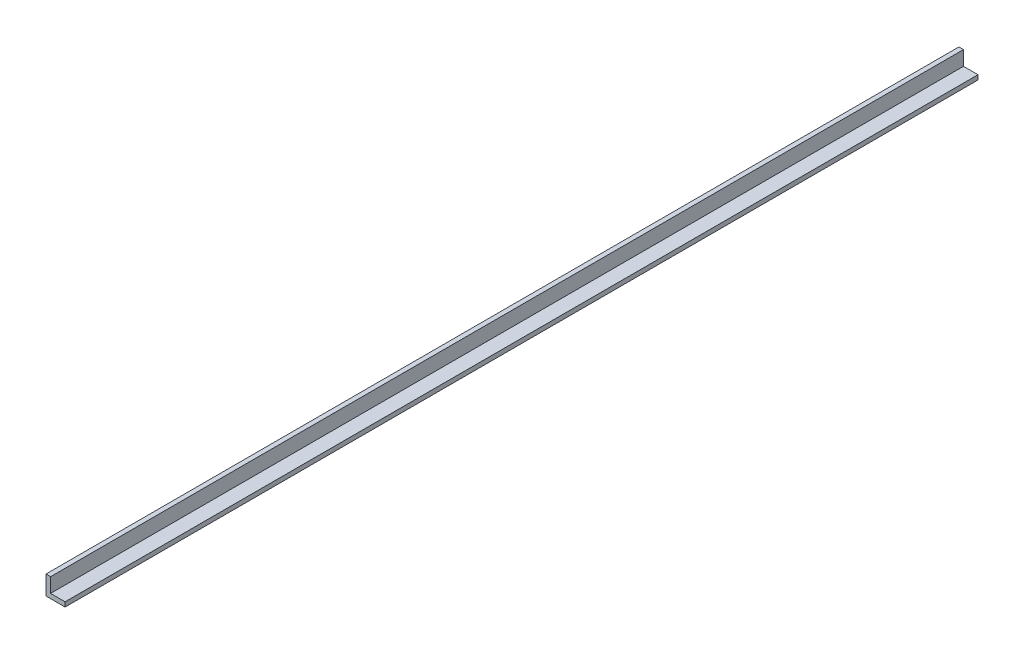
from build123d import *

# Parameters (mm, degrees)
BOSS_EXTRU_1_DEPTH = 2390


with BuildPart() as part:
    # Esquisse1 → Boss.-Extru.1 (new body)
    with BuildSketch(Plane.XY):
        Polygon((0, 0), (50, 0), (50, 12), (12, 12), (12, 50), (0, 50), align=None)
    extrude(amount=BOSS_EXTRU_1_DEPTH)


solid = part.part
